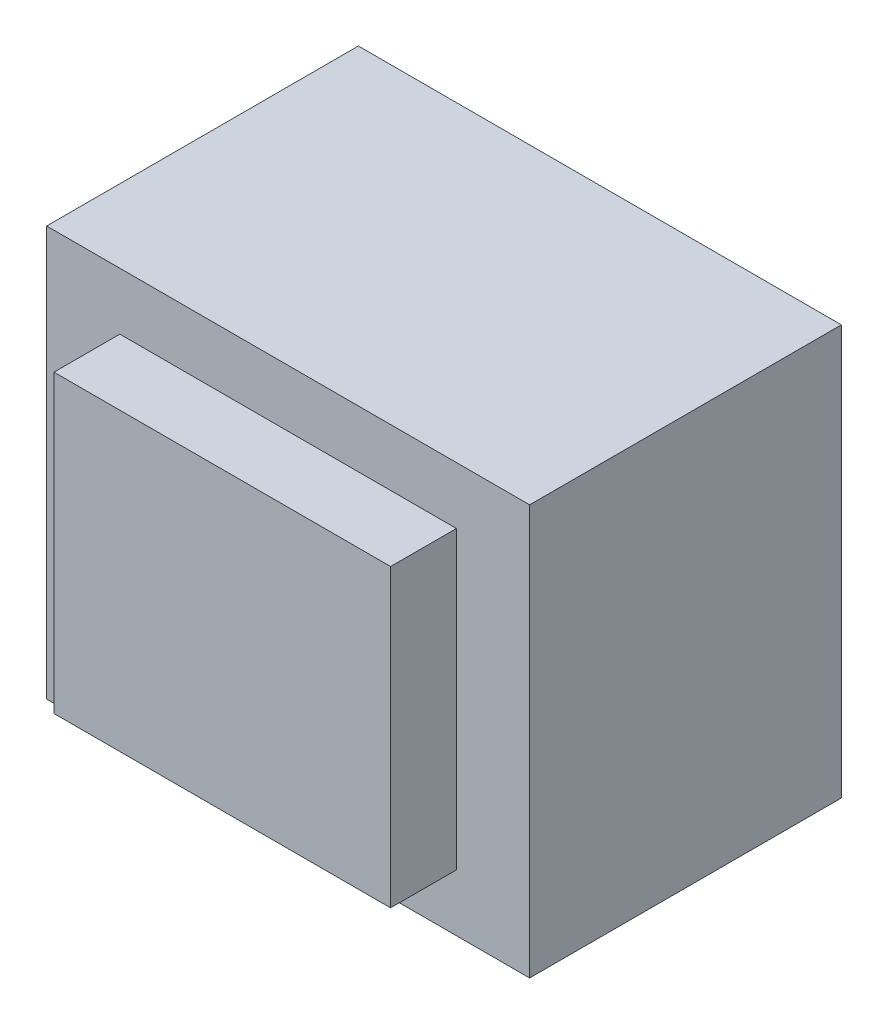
from build123d import *

# Parameters (mm, degrees)
SKETCH1_W              = 33
SKETCH1_H              = 28
BOSS_EXTRUDE1_DEPTH    = 21.3
SKETCH2_W              = 23
SKETCH2_H              = 20.2
BOSS_EXTRUDE2_DEPTH    = 4.5
SKETCH3_R              = 1
BOSS_EXTRUDE3_DEPTH    = 2.54
BOSS_EXTRUDE3_2_DEPTH  = 2.54
BOSS_EXTRUDE3_3_DEPTH  = 2.54
BOSS_EXTRUDE3_4_DEPTH  = 2.54
BOSS_EXTRUDE3_5_DEPTH  = 2.54
BOSS_EXTRUDE3_6_DEPTH  = 2.54
BOSS_EXTRUDE3_7_DEPTH  = 2.54
BOSS_EXTRUDE3_8_DEPTH  = 2.54
BOSS_EXTRUDE3_9_DEPTH  = 2.54
BOSS_EXTRUDE3_10_DEPTH = 2.54


with BuildPart() as part:
    # Sketch1 → Boss-Extrude1 (new body)
    with BuildSketch(Plane.XY):
        Rectangle(SKETCH1_W, SKETCH1_H)
    extrude(amount=BOSS_EXTRUDE1_DEPTH)

    # Sketch2 → Boss-Extrude2 (add)
    with BuildSketch(Plane.XY.offset(21.3)):
        Rectangle(SKETCH2_W, SKETCH2_H)
    extrude(amount=BOSS_EXTRUDE2_DEPTH)


with BuildPart() as body_2:
    # Sketch3 → Boss-Extrude3 (new body)
    with BuildSketch(Plane(origin=(0, 0, 0), x_dir=(-1, 0, 0), z_dir=(0, 0, -1))):
        with Locations((-10, 10)):
            Circle(SKETCH3_R)
    extrude(amount=BOSS_EXTRUDE3_DEPTH)


with BuildPart() as body_3:
    # Sketch3 → Boss-Extrude3 2 (new body)
    with BuildSketch(Plane(origin=(0, 0, 0), x_dir=(-1, 0, 0), z_dir=(0, 0, -1))):
        with Locations((-5, 10)):
            Circle(SKETCH3_R)
    extrude(amount=BOSS_EXTRUDE3_2_DEPTH)


with BuildPart() as body_4:
    # Sketch3 → Boss-Extrude3 3 (new body)
    with BuildSketch(Plane(origin=(0, 0, 0), x_dir=(-1, 0, 0), z_dir=(0, 0, -1))):
        with Locations((0, 10)):
            Circle(SKETCH3_R)
    extrude(amount=BOSS_EXTRUDE3_3_DEPTH)


with BuildPart() as body_5:
    # Sketch3 → Boss-Extrude3 4 (new body)
    with BuildSketch(Plane(origin=(0, 0, 0), x_dir=(-1, 0, 0), z_dir=(0, 0, -1))):
        with Locations((5, 10)):
            Circle(SKETCH3_R)
    extrude(amount=BOSS_EXTRUDE3_4_DEPTH)


with BuildPart() as body_6:
    # Sketch3 → Boss-Extrude3 5 (new body)
    with BuildSketch(Plane(origin=(0, 0, 0), x_dir=(-1, 0, 0), z_dir=(0, 0, -1))):
        with Locations((10, 10)):
            Circle(SKETCH3_R)
    extrude(amount=BOSS_EXTRUDE3_5_DEPTH)


with BuildPart() as body_7:
    # Sketch3 → Boss-Extrude3 6 (new body)
    with BuildSketch(Plane(origin=(0, 0, 0), x_dir=(-1, 0, 0), z_dir=(0, 0, -1))):
        with Locations((-10, -10)):
            Circle(SKETCH3_R)
    extrude(amount=BOSS_EXTRUDE3_6_DEPTH)


with BuildPart() as body_8:
    # Sketch3 → Boss-Extrude3 7 (new body)
    with BuildSketch(Plane(origin=(0, 0, 0), x_dir=(-1, 0, 0), z_dir=(0, 0, -1))):
        with Locations((-5, -10)):
            Circle(SKETCH3_R)
    extrude(amount=BOSS_EXTRUDE3_7_DEPTH)


with BuildPart() as body_9:
    # Sketch3 → Boss-Extrude3 8 (new body)
    with BuildSketch(Plane(origin=(0, 0, 0), x_dir=(-1, 0, 0), z_dir=(0, 0, -1))):
        with Locations((0, -10)):
            Circle(SKETCH3_R)
    extrude(amount=BOSS_EXTRUDE3_8_DEPTH)


with BuildPart() as body_10:
    # Sketch3 → Boss-Extrude3 9 (new body)
    with BuildSketch(Plane(origin=(0, 0, 0), x_dir=(-1, 0, 0), z_dir=(0, 0, -1))):
        with Locations((5, -10)):
            Circle(SKETCH3_R)
    extrude(amount=BOSS_EXTRUDE3_9_DEPTH)


with BuildPart() as body_11:
    # Sketch3 → Boss-Extrude3 10 (new body)
    with BuildSketch(Plane(origin=(0, 0, 0), x_dir=(-1, 0, 0), z_dir=(0, 0, -1))):
        with Locations((10, -10.275746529)):
            Circle(SKETCH3_R)
    extrude(amount=BOSS_EXTRUDE3_10_DEPTH)


solid = Compound([part.part, body_2.part, body_3.part, body_4.part, body_5.part, body_6.part, body_7.part, body_8.part, body_9.part, body_10.part, body_11.part])
